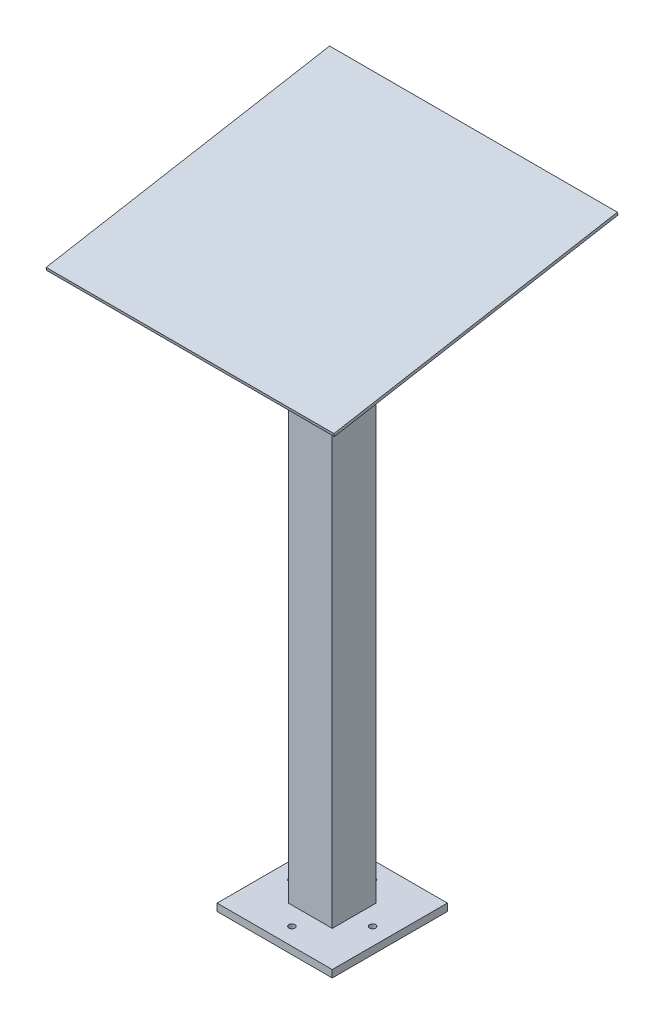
from build123d import *

# Parameters (mm, degrees)
SKETCH1_W           = 200
SKETCH1_H           = 200
SKETCH1_R           = 5.25
BOSS_EXTRUDE1_DEPTH = 12.7
BOSS_EXTRUDE2_DEPTH = 1000
CUT_EXTRUDE1_DEPTH  = 1027.953212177
BOSS_EXTRUDE3_DEPTH = 5


with BuildPart() as part:
    # Sketch1 → Boss-Extrude1 (new body)
    with BuildSketch(Plane(origin=(0, 0, 0), x_dir=(1, 0, 0), z_dir=(0, 1, 0))):
        Rectangle(SKETCH1_W, SKETCH1_H)
        with Locations(Location((0, 69.999999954, 0), (0, 0, 270))):
            Circle(SKETCH1_R, mode=Mode.SUBTRACT)
        with Locations(Location((69.999999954, 0, 0), (0, 0, 270))):
            Circle(SKETCH1_R, mode=Mode.SUBTRACT)
        with Locations(Location((0, -69.999999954, 0), (0, 0, 270))):
            Circle(SKETCH1_R, mode=Mode.SUBTRACT)
        with Locations(Location((-69.999999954, 0, 0), (0, 0, 270))):
            Circle(SKETCH1_R, mode=Mode.SUBTRACT)
    extrude(amount=BOSS_EXTRUDE1_DEPTH)

    # Sketch2 → Boss-Extrude2 (add)
    with BuildSketch(Plane(origin=(0, 12.7, 0), x_dir=(1, 0, 0), z_dir=(0, 1, 0))):
        Polygon((38.1, 38.1), (38.1, -38.1), (-38.1, -38.1), align=None)
        Polygon((-38.1, 38.1), (38.1, 38.1), (-38.1, -38.1), align=None)
    extrude(amount=BOSS_EXTRUDE2_DEPTH)

    # Sketch3 → Cut-Extrude1 (cut, through all)
    with BuildSketch(Plane.ZY.offset(38.1)):
        Polygon((-38.1, 1012.7), (38.1, 999.26388407), (38.1, 1012.7), align=None)
    extrude(amount=-CUT_EXTRUDE1_DEPTH, mode=Mode.SUBTRACT)


with BuildPart() as body_2:
    # Sketch4 → Boss-Extrude3 (new body)
    with BuildSketch(Plane(origin=(0, 975.647874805, 172.033043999), x_dir=(1, 0, 0), z_dir=(0, 0.9848077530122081, 0.17364817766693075))):
        Polygon((-38.1, 212.786931), (-250, 424.686931), (-250, -75.313069), (250, -75.313069), (38.1, 136.586931), (38.1, 135.999177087), (-38.1, 135.999177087), align=None)
        Polygon((250, 424.686931), (-250, 424.686931), (-38.1, 212.786931), (-38.1, 213.374684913), (38.1, 213.374684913), (38.1, 136.586931), (250, -75.313069), align=None)
        Polygon((0, 174.686931), (-38.1, 212.786931), (-38.1, 135.999177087), align=None)
        Polygon((-38.1, 213.374684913), (-38.1, 212.786931), (0, 174.686931), (38.1, 213.374684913), align=None)
        Polygon((38.1, 213.374684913), (0, 174.686931), (38.1, 136.586931), align=None)
        Polygon((38.1, 136.586931), (0, 174.686931), (-38.1, 135.999177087), (38.1, 135.999177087), align=None)
    extrude(amount=BOSS_EXTRUDE3_DEPTH)


solid = Compound([part.part, body_2.part])
